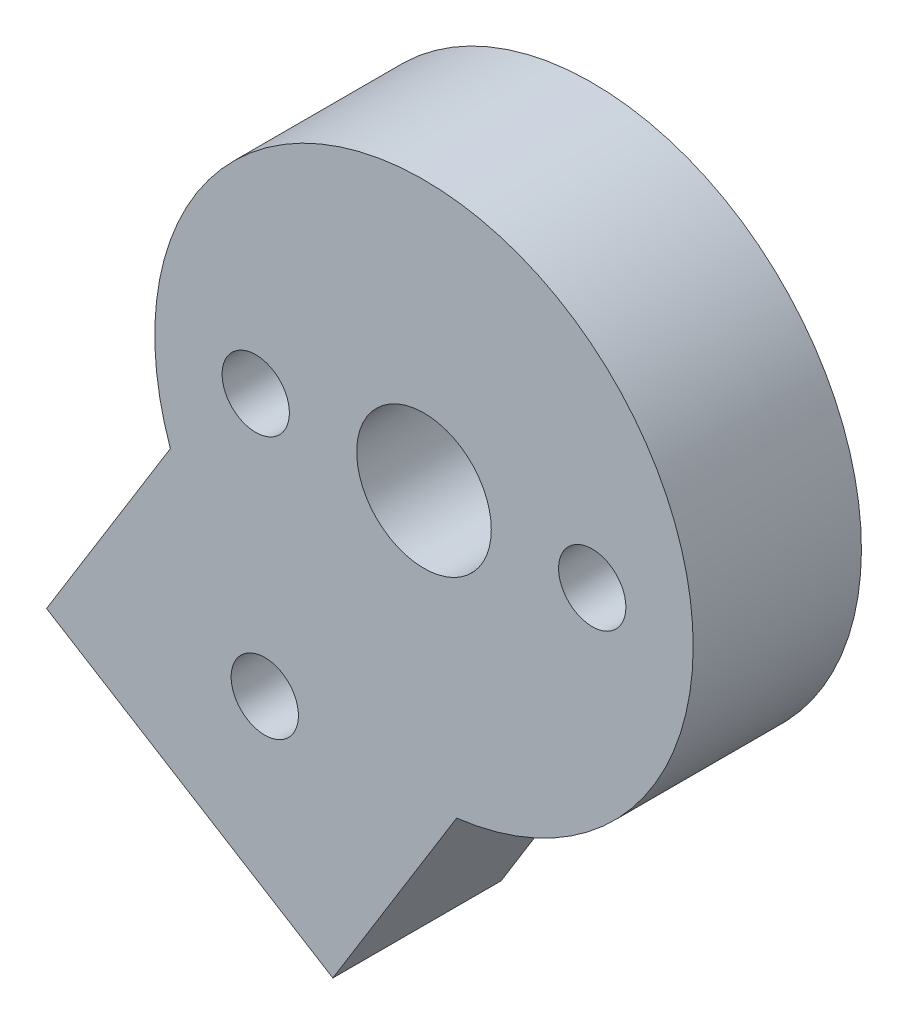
ISO-10303-21;
HEADER;
FILE_DESCRIPTION(('STEP AP214'),'2;1');
FILE_NAME('part.step','',(''),(''),'','','');
FILE_SCHEMA(('AUTOMOTIVE_DESIGN { 1 0 10303 214 1 1 1 1 }'));
ENDSEC;
DATA;
#1=APPLICATION_CONTEXT('core data for automotive mechanical design processes');
#2=APPLICATION_PROTOCOL_DEFINITION('international standard','automotive_design',2000,#1);
#3=PRODUCT_CONTEXT('',#1,'mechanical');
#4=PRODUCT('Part','Part','',(#3));
#5=PRODUCT_RELATED_PRODUCT_CATEGORY('part','',(#4));
#6=PRODUCT_DEFINITION_FORMATION('','',#4);
#7=PRODUCT_DEFINITION_CONTEXT('part definition',#1,'design');
#8=PRODUCT_DEFINITION('design','',#6,#7);
#9=PRODUCT_DEFINITION_SHAPE('','',#8);
#10=(LENGTH_UNIT() NAMED_UNIT(*) SI_UNIT(.MILLI.,.METRE.));
#11=(NAMED_UNIT(*) PLANE_ANGLE_UNIT() SI_UNIT($,.RADIAN.));
#12=(NAMED_UNIT(*) SI_UNIT($,.STERADIAN.) SOLID_ANGLE_UNIT());
#13=UNCERTAINTY_MEASURE_WITH_UNIT(LENGTH_MEASURE(1.E-05),#10,'distance_accuracy_value','');
#14=(GEOMETRIC_REPRESENTATION_CONTEXT(3) GLOBAL_UNCERTAINTY_ASSIGNED_CONTEXT((#13)) GLOBAL_UNIT_ASSIGNED_CONTEXT((#10,
#11,#12)) REPRESENTATION_CONTEXT('',''));
#15=CARTESIAN_POINT('',(0.,0.,0.));
#16=DIRECTION('',(0.,0.,1.));
#17=DIRECTION('',(1.,0.,0.));
#18=AXIS2_PLACEMENT_3D('',#15,#16,#17);
#19=CARTESIAN_POINT('',(-11.2155853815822,-8.63948010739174,5.));
#20=DIRECTION('',(0.525634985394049,0.850710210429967,0.));
#21=DIRECTION('',(-0.850710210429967,0.525634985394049,0.));
#22=AXIS2_PLACEMENT_3D('',#19,#20,#21);
#23=PLANE('',#22);
#24=DIRECTION('',(0.850710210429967,-0.525634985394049,0.));
#25=VECTOR('',#24,1.);
#26=CARTESIAN_POINT('',(-11.2155853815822,-8.63948010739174,0.));
#27=LINE('',#26,#25);
#28=CARTESIAN_POINT('',(-11.2155853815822,-8.63948010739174,0.));
#29=VERTEX_POINT('',#28);
#30=CARTESIAN_POINT('',(-2.70848327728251,-13.8958299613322,0.));
#31=VERTEX_POINT('',#30);
#32=EDGE_CURVE('E96',#29,#31,#27,.T.);
#33=ORIENTED_EDGE('',*,*,#32,.T.);
#34=DIRECTION('',(0.,0.,-1.));
#35=VECTOR('',#34,1.);
#36=CARTESIAN_POINT('',(-2.70848327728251,-13.8958299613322,5.));
#37=LINE('',#36,#35);
#38=CARTESIAN_POINT('',(-2.70848327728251,-13.8958299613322,5.));
#39=VERTEX_POINT('',#38);
#40=EDGE_CURVE('E11',#39,#31,#37,.T.);
#41=ORIENTED_EDGE('',*,*,#40,.F.);
#42=DIRECTION('',(0.850710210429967,-0.525634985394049,0.));
#43=VECTOR('',#42,1.);
#44=CARTESIAN_POINT('',(-11.2155853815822,-8.63948010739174,5.));
#45=LINE('',#44,#43);
#46=CARTESIAN_POINT('',(-11.2155853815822,-8.63948010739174,5.));
#47=VERTEX_POINT('',#46);
#48=EDGE_CURVE('E84',#47,#39,#45,.T.);
#49=ORIENTED_EDGE('',*,*,#48,.F.);
#50=DIRECTION('',(0.,0.,-1.));
#51=VECTOR('',#50,1.);
#52=CARTESIAN_POINT('',(-11.2155853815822,-8.63948010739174,5.));
#53=LINE('',#52,#51);
#54=EDGE_CURVE('E92',#47,#29,#53,.T.);
#55=ORIENTED_EDGE('',*,*,#54,.T.);
#56=EDGE_LOOP('',(#33,#41,#49,#55));
#57=FACE_BOUND('',#56,.T.);
#58=ADVANCED_FACE('F33',(#57),#23,.F.);
#59=CARTESIAN_POINT('',(-2.70848327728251,-13.8958299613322,5.));
#60=DIRECTION('',(-0.850710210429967,0.525634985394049,0.));
#61=DIRECTION('',(-0.525634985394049,-0.850710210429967,0.));
#62=AXIS2_PLACEMENT_3D('',#59,#60,#61);
#63=PLANE('',#62);
#64=DIRECTION('',(0.525634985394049,0.850710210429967,0.));
#65=VECTOR('',#64,1.);
#66=CARTESIAN_POINT('',(-2.70848327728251,-13.8958299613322,0.));
#67=LINE('',#66,#65);
#68=CARTESIAN_POINT('',(0.970961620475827,-7.94085848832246,0.));
#69=VERTEX_POINT('',#68);
#70=EDGE_CURVE('E88',#31,#69,#67,.T.);
#71=ORIENTED_EDGE('',*,*,#70,.T.);
#72=DIRECTION('',(0.,0.,-1.));
#73=VECTOR('',#72,1.);
#74=CARTESIAN_POINT('',(0.970961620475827,-7.94085848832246,5.));
#75=LINE('',#74,#73);
#76=CARTESIAN_POINT('',(0.970961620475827,-7.94085848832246,5.));
#77=VERTEX_POINT('',#76);
#78=EDGE_CURVE('E41',#77,#69,#75,.T.);
#79=ORIENTED_EDGE('',*,*,#78,.F.);
#80=DIRECTION('',(0.525634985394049,0.850710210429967,0.));
#81=VECTOR('',#80,1.);
#82=CARTESIAN_POINT('',(-2.70848327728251,-13.8958299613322,5.));
#83=LINE('',#82,#81);
#84=EDGE_CURVE('E79',#39,#77,#83,.T.);
#85=ORIENTED_EDGE('',*,*,#84,.F.);
#86=ORIENTED_EDGE('',*,*,#40,.T.);
#87=EDGE_LOOP('',(#71,#79,#85,#86));
#88=FACE_BOUND('',#87,.T.);
#89=ADVANCED_FACE('F87',(#88),#63,.F.);
#90=CARTESIAN_POINT('',(0.,0.,5.));
#91=DIRECTION('',(0.,0.,-1.));
#92=DIRECTION('',(-1.,0.,0.));
#93=AXIS2_PLACEMENT_3D('',#90,#91,#92);
#94=CYLINDRICAL_SURFACE('',#93,8.);
#95=CARTESIAN_POINT('',(0.,0.,0.));
#96=DIRECTION('',(0.,0.,1.));
#97=DIRECTION('',(1.,0.,0.));
#98=AXIS2_PLACEMENT_3D('',#95,#96,#97);
#99=CIRCLE('',#98,8.);
#100=CARTESIAN_POINT('',(-7.53614048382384,-2.68450863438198,0.));
#101=VERTEX_POINT('',#100);
#102=EDGE_CURVE('E66',#69,#101,#99,.T.);
#103=ORIENTED_EDGE('',*,*,#102,.T.);
#104=DIRECTION('',(0.,0.,-1.));
#105=VECTOR('',#104,1.);
#106=CARTESIAN_POINT('',(-7.53614048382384,-2.68450863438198,5.));
#107=LINE('',#106,#105);
#108=CARTESIAN_POINT('',(-7.53614048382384,-2.68450863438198,5.));
#109=VERTEX_POINT('',#108);
#110=EDGE_CURVE('E89',#109,#101,#107,.T.);
#111=ORIENTED_EDGE('',*,*,#110,.F.);
#112=CARTESIAN_POINT('',(0.,0.,5.));
#113=DIRECTION('',(0.,0.,1.));
#114=DIRECTION('',(1.,0.,0.));
#115=AXIS2_PLACEMENT_3D('',#112,#113,#114);
#116=CIRCLE('',#115,8.);
#117=EDGE_CURVE('E82',#77,#109,#116,.T.);
#118=ORIENTED_EDGE('',*,*,#117,.F.);
#119=ORIENTED_EDGE('',*,*,#78,.T.);
#120=EDGE_LOOP('',(#103,#111,#118,#119));
#121=FACE_BOUND('',#120,.T.);
#122=ADVANCED_FACE('F90',(#121),#94,.T.);
#123=CARTESIAN_POINT('',(-7.53614048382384,-2.68450863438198,5.));
#124=DIRECTION('',(0.850710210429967,-0.525634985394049,0.));
#125=DIRECTION('',(0.525634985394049,0.850710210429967,0.));
#126=AXIS2_PLACEMENT_3D('',#123,#124,#125);
#127=PLANE('',#126);
#128=DIRECTION('',(-0.525634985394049,-0.850710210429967,0.));
#129=VECTOR('',#128,1.);
#130=CARTESIAN_POINT('',(-7.53614048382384,-2.68450863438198,0.));
#131=LINE('',#130,#129);
#132=EDGE_CURVE('E72',#101,#29,#131,.T.);
#133=ORIENTED_EDGE('',*,*,#132,.T.);
#134=ORIENTED_EDGE('',*,*,#54,.F.);
#135=DIRECTION('',(-0.525634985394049,-0.850710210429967,0.));
#136=VECTOR('',#135,1.);
#137=CARTESIAN_POINT('',(-7.53614048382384,-2.68450863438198,5.));
#138=LINE('',#137,#136);
#139=EDGE_CURVE('E49',#109,#47,#138,.T.);
#140=ORIENTED_EDGE('',*,*,#139,.F.);
#141=ORIENTED_EDGE('',*,*,#110,.T.);
#142=EDGE_LOOP('',(#133,#134,#140,#141));
#143=FACE_BOUND('',#142,.T.);
#144=ADVANCED_FACE('F104',(#143),#127,.F.);
#145=CARTESIAN_POINT('',(0.,0.,5.));
#146=DIRECTION('',(0.,0.,1.));
#147=DIRECTION('',(1.,0.,0.));
#148=AXIS2_PLACEMENT_3D('',#145,#146,#147);
#149=PLANE('',#148);
#150=CARTESIAN_POINT('',(-5.,0.,5.));
#151=DIRECTION('',(0.,0.,1.));
#152=DIRECTION('',(1.,0.,0.));
#153=AXIS2_PLACEMENT_3D('',#150,#151,#152);
#154=CIRCLE('',#153,1.);
#155=CARTESIAN_POINT('',(-4.,0.,5.));
#156=VERTEX_POINT('',#155);
#157=EDGE_CURVE('E128',#156,#156,#154,.T.);
#158=ORIENTED_EDGE('',*,*,#157,.F.);
#159=EDGE_LOOP('',(#158));
#160=FACE_BOUND('',#159,.T.);
#161=CARTESIAN_POINT('',(5.,0.,5.));
#162=DIRECTION('',(0.,0.,1.));
#163=DIRECTION('',(1.,0.,0.));
#164=AXIS2_PLACEMENT_3D('',#161,#162,#163);
#165=CIRCLE('',#164,1.);
#166=CARTESIAN_POINT('',(6.,0.,5.));
#167=VERTEX_POINT('',#166);
#168=EDGE_CURVE('E122',#167,#167,#165,.T.);
#169=ORIENTED_EDGE('',*,*,#168,.F.);
#170=EDGE_LOOP('',(#169));
#171=FACE_BOUND('',#170,.T.);
#172=CARTESIAN_POINT('',(-4.73071486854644,-7.6563918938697,5.));
#173=DIRECTION('',(0.,0.,1.));
#174=DIRECTION('',(1.,0.,0.));
#175=AXIS2_PLACEMENT_3D('',#172,#173,#174);
#176=CIRCLE('',#175,1.);
#177=CARTESIAN_POINT('',(-3.73071486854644,-7.6563918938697,5.));
#178=VERTEX_POINT('',#177);
#179=EDGE_CURVE('E116',#178,#178,#176,.T.);
#180=ORIENTED_EDGE('',*,*,#179,.F.);
#181=EDGE_LOOP('',(#180));
#182=FACE_BOUND('',#181,.T.);
#183=CARTESIAN_POINT('',(0.,0.,5.));
#184=DIRECTION('',(0.,0.,1.));
#185=DIRECTION('',(1.,0.,0.));
#186=AXIS2_PLACEMENT_3D('',#183,#184,#185);
#187=CIRCLE('',#186,2.);
#188=CARTESIAN_POINT('',(2.,0.,5.));
#189=VERTEX_POINT('',#188);
#190=EDGE_CURVE('E110',#189,#189,#187,.T.);
#191=ORIENTED_EDGE('',*,*,#190,.F.);
#192=EDGE_LOOP('',(#191));
#193=FACE_BOUND('',#192,.T.);
#194=ORIENTED_EDGE('',*,*,#48,.T.);
#195=ORIENTED_EDGE('',*,*,#84,.T.);
#196=ORIENTED_EDGE('',*,*,#117,.T.);
#197=ORIENTED_EDGE('',*,*,#139,.T.);
#198=EDGE_LOOP('',(#194,#195,#196,#197));
#199=FACE_BOUND('',#198,.T.);
#200=ADVANCED_FACE('F80',(#160,#171,#182,#193,#199),#149,.T.);
#201=CARTESIAN_POINT('',(0.,0.,0.));
#202=DIRECTION('',(0.,0.,1.));
#203=DIRECTION('',(1.,0.,0.));
#204=AXIS2_PLACEMENT_3D('',#201,#202,#203);
#205=PLANE('',#204);
#206=CARTESIAN_POINT('',(-5.,0.,0.));
#207=DIRECTION('',(0.,0.,1.));
#208=DIRECTION('',(1.,0.,0.));
#209=AXIS2_PLACEMENT_3D('',#206,#207,#208);
#210=CIRCLE('',#209,1.);
#211=CARTESIAN_POINT('',(-4.,0.,0.));
#212=VERTEX_POINT('',#211);
#213=EDGE_CURVE('E125',#212,#212,#210,.T.);
#214=ORIENTED_EDGE('',*,*,#213,.T.);
#215=EDGE_LOOP('',(#214));
#216=FACE_BOUND('',#215,.T.);
#217=CARTESIAN_POINT('',(5.,0.,0.));
#218=DIRECTION('',(0.,0.,1.));
#219=DIRECTION('',(1.,0.,0.));
#220=AXIS2_PLACEMENT_3D('',#217,#218,#219);
#221=CIRCLE('',#220,1.);
#222=CARTESIAN_POINT('',(6.,0.,0.));
#223=VERTEX_POINT('',#222);
#224=EDGE_CURVE('E119',#223,#223,#221,.T.);
#225=ORIENTED_EDGE('',*,*,#224,.T.);
#226=EDGE_LOOP('',(#225));
#227=FACE_BOUND('',#226,.T.);
#228=CARTESIAN_POINT('',(-4.73071486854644,-7.6563918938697,0.));
#229=DIRECTION('',(0.,0.,1.));
#230=DIRECTION('',(1.,0.,0.));
#231=AXIS2_PLACEMENT_3D('',#228,#229,#230);
#232=CIRCLE('',#231,1.);
#233=CARTESIAN_POINT('',(-3.73071486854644,-7.6563918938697,0.));
#234=VERTEX_POINT('',#233);
#235=EDGE_CURVE('E113',#234,#234,#232,.T.);
#236=ORIENTED_EDGE('',*,*,#235,.T.);
#237=EDGE_LOOP('',(#236));
#238=FACE_BOUND('',#237,.T.);
#239=CARTESIAN_POINT('',(0.,0.,0.));
#240=DIRECTION('',(0.,0.,1.));
#241=DIRECTION('',(1.,0.,0.));
#242=AXIS2_PLACEMENT_3D('',#239,#240,#241);
#243=CIRCLE('',#242,2.);
#244=CARTESIAN_POINT('',(2.,0.,0.));
#245=VERTEX_POINT('',#244);
#246=EDGE_CURVE('E99',#245,#245,#243,.T.);
#247=ORIENTED_EDGE('',*,*,#246,.T.);
#248=EDGE_LOOP('',(#247));
#249=FACE_BOUND('',#248,.T.);
#250=ORIENTED_EDGE('',*,*,#32,.F.);
#251=ORIENTED_EDGE('',*,*,#132,.F.);
#252=ORIENTED_EDGE('',*,*,#102,.F.);
#253=ORIENTED_EDGE('',*,*,#70,.F.);
#254=EDGE_LOOP('',(#250,#251,#252,#253));
#255=FACE_BOUND('',#254,.T.);
#256=ADVANCED_FACE('F107',(#216,#227,#238,#249,#255),#205,.F.);
#257=CARTESIAN_POINT('',(0.,0.,0.));
#258=DIRECTION('',(0.,0.,1.));
#259=DIRECTION('',(1.,0.,0.));
#260=AXIS2_PLACEMENT_3D('',#257,#258,#259);
#261=CYLINDRICAL_SURFACE('',#260,2.);
#262=ORIENTED_EDGE('',*,*,#246,.F.);
#263=EDGE_LOOP('',(#262));
#264=FACE_BOUND('',#263,.T.);
#265=ORIENTED_EDGE('',*,*,#190,.T.);
#266=EDGE_LOOP('',(#265));
#267=FACE_BOUND('',#266,.T.);
#268=ADVANCED_FACE('F152',(#264,#267),#261,.F.);
#269=CARTESIAN_POINT('',(-4.73071486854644,-7.6563918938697,0.));
#270=DIRECTION('',(0.,0.,1.));
#271=DIRECTION('',(1.,0.,0.));
#272=AXIS2_PLACEMENT_3D('',#269,#270,#271);
#273=CYLINDRICAL_SURFACE('',#272,1.);
#274=ORIENTED_EDGE('',*,*,#235,.F.);
#275=EDGE_LOOP('',(#274));
#276=FACE_BOUND('',#275,.T.);
#277=ORIENTED_EDGE('',*,*,#179,.T.);
#278=EDGE_LOOP('',(#277));
#279=FACE_BOUND('',#278,.T.);
#280=ADVANCED_FACE('F154',(#276,#279),#273,.F.);
#281=CARTESIAN_POINT('',(5.,0.,0.));
#282=DIRECTION('',(0.,0.,1.));
#283=DIRECTION('',(1.,0.,0.));
#284=AXIS2_PLACEMENT_3D('',#281,#282,#283);
#285=CYLINDRICAL_SURFACE('',#284,1.);
#286=ORIENTED_EDGE('',*,*,#224,.F.);
#287=EDGE_LOOP('',(#286));
#288=FACE_BOUND('',#287,.T.);
#289=ORIENTED_EDGE('',*,*,#168,.T.);
#290=EDGE_LOOP('',(#289));
#291=FACE_BOUND('',#290,.T.);
#292=ADVANCED_FACE('F139',(#288,#291),#285,.F.);
#293=CARTESIAN_POINT('',(-5.,0.,0.));
#294=DIRECTION('',(0.,0.,1.));
#295=DIRECTION('',(1.,0.,0.));
#296=AXIS2_PLACEMENT_3D('',#293,#294,#295);
#297=CYLINDRICAL_SURFACE('',#296,1.);
#298=ORIENTED_EDGE('',*,*,#213,.F.);
#299=EDGE_LOOP('',(#298));
#300=FACE_BOUND('',#299,.T.);
#301=ORIENTED_EDGE('',*,*,#157,.T.);
#302=EDGE_LOOP('',(#301));
#303=FACE_BOUND('',#302,.T.);
#304=ADVANCED_FACE('F136',(#300,#303),#297,.F.);
#305=CLOSED_SHELL('',(#58,#89,#122,#144,#200,#256,#268,#280,#292,#304));
#306=MANIFOLD_SOLID_BREP('B2',#305);
#307=ADVANCED_BREP_SHAPE_REPRESENTATION('',(#18,#306),#14);
#308=SHAPE_DEFINITION_REPRESENTATION(#9,#307);
ENDSEC;
END-ISO-10303-21;
